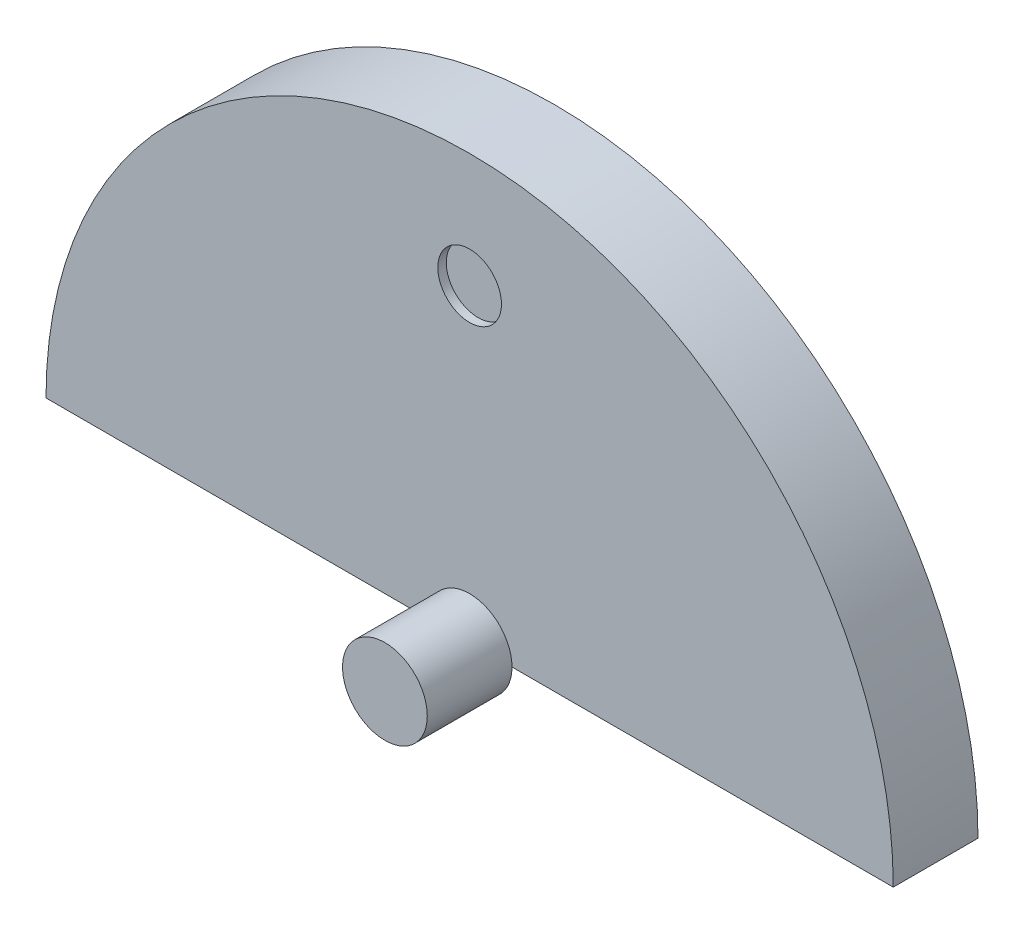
from build123d import *

# Parameters (mm, degrees)
BOSS_EXTRU_1_DEPTH      = 100
ESQUISSE4_R             = 50
BOSS_EXTRU_2_DEPTH      = 100
ESQUISSE5_R             = 37.558974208
ENL_V_MAT_EXTRU_1_DEPTH = 10


with BuildPart() as part:
    # Esquisse1 → Boss.-Extru.1 (new body)
    with BuildSketch(Plane.XY):
        with BuildLine():
            Line((-500, 0), (500, 0))
            ThreePointArc((500, 0), (0, 500), (-500, 0))
        make_face()
    extrude(amount=BOSS_EXTRU_1_DEPTH)

    # Esquisse4 → Boss.-Extru.2 (add)
    with BuildSketch(Plane.XY.offset(100)):
        Circle(ESQUISSE4_R)
    extrude(amount=BOSS_EXTRU_2_DEPTH)

    # Esquisse5 → Enl_v. mat.-Extru.1 (cut)
    with BuildSketch(Plane.XY.offset(100)):
        with Locations((0, 364.679377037)):
            Circle(ESQUISSE5_R)
    extrude(amount=-ENL_V_MAT_EXTRU_1_DEPTH, mode=Mode.SUBTRACT)


solid = part.part
